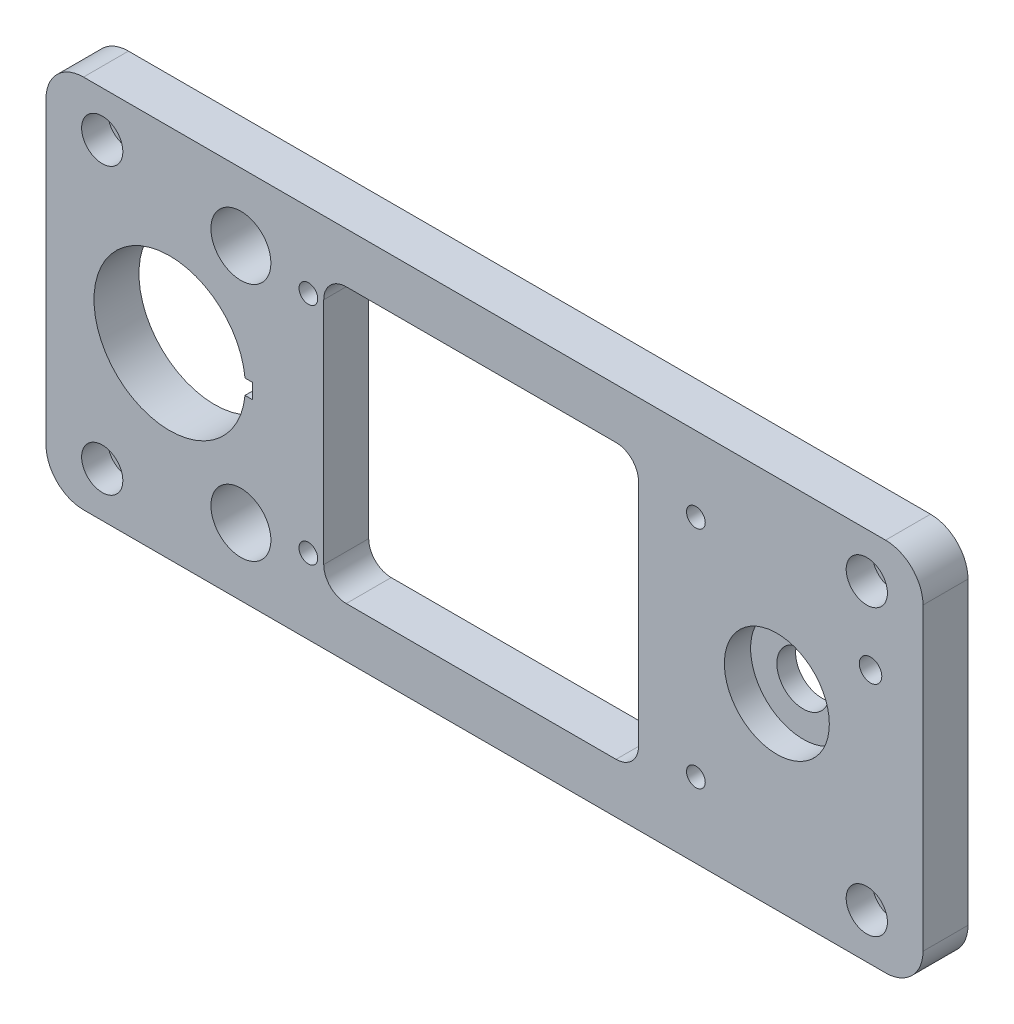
from build123d import *

# Parameters (mm, degrees)
SKETCH1_R           = 1.75
SKETCH1_R_2         = 3.5
SKETCH1_R_3         = 1.25000004
SKETCH1_R_4         = 1.25
SKETCH1_R_5         = 1.5
SKETCH1_R_6         = 4
BOSS_EXTRUDE1_DEPTH = 6
SKETCH2_R           = 2.75
SKETCH2_R_2         = 7
CUT_EXTRUDE1_DEPTH  = 3.5


with BuildPart() as part:
    # Sketch1 → Boss-Extrude1 (new body)
    with BuildSketch(Plane.XY):
        with BuildLine():
            Line((5, 0), (112, 0))
            ThreePointArc((112, 0), (115.535533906, 1.464466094), (117, 5))
            Line((117, 5), (117, 45))
            ThreePointArc((117, 45), (115.535533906, 48.535533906), (112, 50))
            Line((112, 50), (5, 50))
            ThreePointArc((5, 50), (1.464466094, 48.535533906), (0, 45))
            Line((0, 45), (0, 5))
            ThreePointArc((0, 5), (1.464466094, 1.464466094), (5, 0))
        make_face()
        with Locations(Location((109.5, 44, 0), (0, 0, 180))):
            Circle(SKETCH1_R, mode=Mode.SUBTRACT)
        with Locations((7.5, 44)):
            Circle(SKETCH1_R, mode=Mode.SUBTRACT)
        with Locations((109.5, 6)):
            Circle(SKETCH1_R, mode=Mode.SUBTRACT)
        with Locations(Location((7.5, 6, 0), (0, 0, 180))):
            Circle(SKETCH1_R, mode=Mode.SUBTRACT)
        with Locations((97.500085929, 24.999938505)):
            Circle(SKETCH1_R_2, mode=Mode.SUBTRACT)
        with Locations((86.70040182, 40.00000238)):
            Circle(SKETCH1_R_3, mode=Mode.SUBTRACT)
        with Locations((86.70040182, 10.00000142)):
            Circle(SKETCH1_R_4, mode=Mode.SUBTRACT)
        with Locations((35.00040108, 10.00000142)):
            Circle(SKETCH1_R_4, mode=Mode.SUBTRACT)
        with Locations((35.00040108, 40.00000238)):
            Circle(SKETCH1_R_4, mode=Mode.SUBTRACT)
        with Locations((110, 34)):
            Circle(SKETCH1_R_5, mode=Mode.SUBTRACT)
        with Locations((26, 41)):
            Circle(SKETCH1_R_6, mode=Mode.SUBTRACT)
        with Locations(Location((26, 9, 0), (0, 0, 180))):
            Circle(SKETCH1_R_6, mode=Mode.SUBTRACT)
        with BuildLine():
            Line((40.050354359, 43.300060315), (76.050354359, 43.300060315))
            ThreePointArc((76.050354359, 43.300060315), (78.171674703, 42.421380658), (79.050354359, 40.300060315))
            Line((79.050354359, 40.300060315), (79.050354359, 9.700060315))
            ThreePointArc((79.050354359, 9.700060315), (78.171674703, 7.578739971), (76.050354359, 6.700060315))
            Line((76.050354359, 6.700060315), (40.050354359, 6.700060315))
            ThreePointArc((40.050354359, 6.700060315), (37.929034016, 7.578739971), (37.050354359, 9.700060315))
            Line((37.050354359, 9.700060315), (37.050354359, 40.300060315))
            ThreePointArc((37.050354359, 40.300060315), (37.929034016, 42.421380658), (40.050354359, 43.300060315))
        make_face(mode=Mode.SUBTRACT)
        with BuildLine():
            Line((27.550373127, 26), (26.550373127, 26))
            ThreePointArc((26.550373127, 26), (6.4, 25), (26.550373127, 24))
            Line((26.550373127, 24), (27.550373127, 24))
            Line((27.550373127, 24), (27.550373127, 26))
        make_face(mode=Mode.SUBTRACT)
    extrude(amount=BOSS_EXTRUDE1_DEPTH)

    # Sketch2 → Cut-Extrude1 (cut)
    with BuildSketch(Plane.XY.offset(6)):
        with Locations((7.5, 44)):
            Circle(SKETCH2_R)
        with Locations((7.5, 6)):
            Circle(SKETCH2_R)
        with Locations((109.5, 44)):
            Circle(SKETCH2_R)
        with Locations((109.5, 6)):
            Circle(SKETCH2_R)
        with Locations((97.500085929, 24.999938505)):
            Circle(SKETCH2_R_2)
    extrude(amount=-CUT_EXTRUDE1_DEPTH, mode=Mode.SUBTRACT)


solid = part.part
